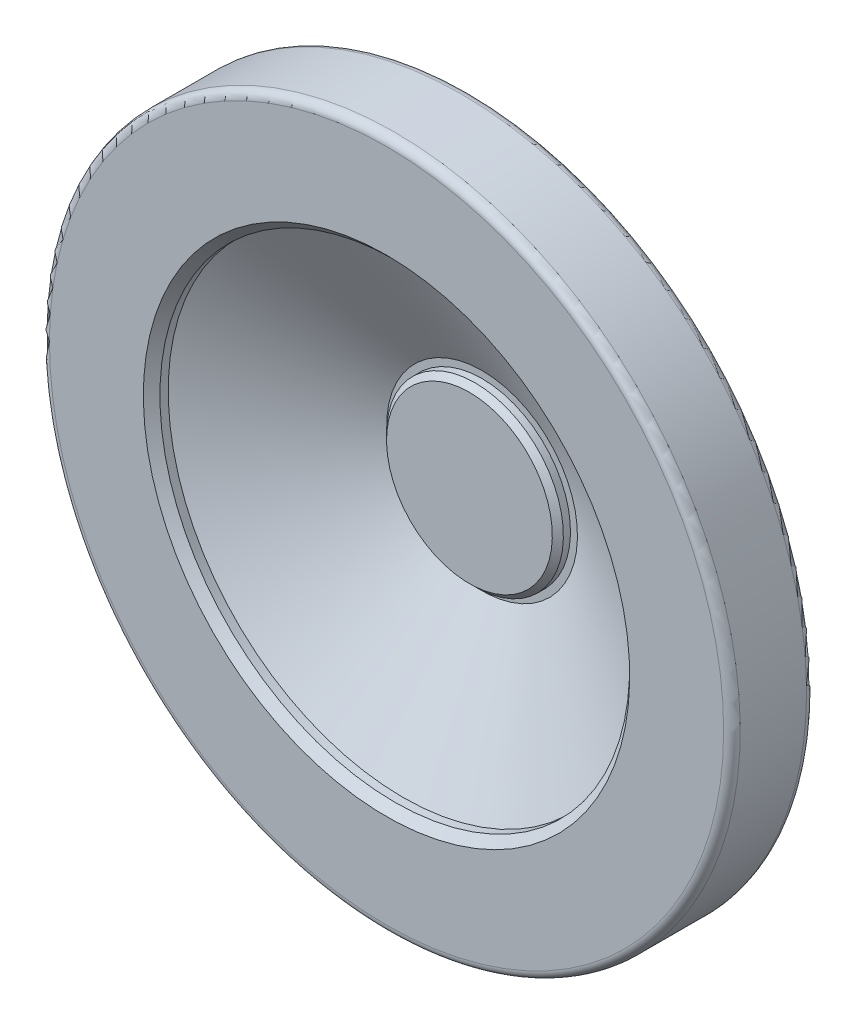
ISO-10303-21;
HEADER;
FILE_DESCRIPTION(('STEP AP214'),'2;1');
FILE_NAME('part.step','',(''),(''),'','','');
FILE_SCHEMA(('AUTOMOTIVE_DESIGN { 1 0 10303 214 1 1 1 1 }'));
ENDSEC;
DATA;
#1=APPLICATION_CONTEXT('core data for automotive mechanical design processes');
#2=APPLICATION_PROTOCOL_DEFINITION('international standard','automotive_design',2000,#1);
#3=PRODUCT_CONTEXT('',#1,'mechanical');
#4=PRODUCT('Part','Part','',(#3));
#5=PRODUCT_RELATED_PRODUCT_CATEGORY('part','',(#4));
#6=PRODUCT_DEFINITION_FORMATION('','',#4);
#7=PRODUCT_DEFINITION_CONTEXT('part definition',#1,'design');
#8=PRODUCT_DEFINITION('design','',#6,#7);
#9=PRODUCT_DEFINITION_SHAPE('','',#8);
#10=(LENGTH_UNIT() NAMED_UNIT(*) SI_UNIT(.MILLI.,.METRE.));
#11=(NAMED_UNIT(*) PLANE_ANGLE_UNIT() SI_UNIT($,.RADIAN.));
#12=(NAMED_UNIT(*) SI_UNIT($,.STERADIAN.) SOLID_ANGLE_UNIT());
#13=UNCERTAINTY_MEASURE_WITH_UNIT(LENGTH_MEASURE(1.E-05),#10,'distance_accuracy_value','');
#14=(GEOMETRIC_REPRESENTATION_CONTEXT(3) GLOBAL_UNCERTAINTY_ASSIGNED_CONTEXT((#13)) GLOBAL_UNIT_ASSIGNED_CONTEXT((#10,
#11,#12)) REPRESENTATION_CONTEXT('',''));
#15=CARTESIAN_POINT('',(0.,0.,0.));
#16=DIRECTION('',(0.,0.,1.));
#17=DIRECTION('',(1.,0.,0.));
#18=AXIS2_PLACEMENT_3D('',#15,#16,#17);
#19=CARTESIAN_POINT('',(0.,0.,10.9999999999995));
#20=DIRECTION('',(0.,0.,-1.));
#21=DIRECTION('',(0.,-1.,0.));
#22=AXIS2_PLACEMENT_3D('',#19,#20,#21);
#23=CONICAL_SURFACE('',#22,2.99999999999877,1.0471975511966);
#24=CARTESIAN_POINT('',(0.,0.,12.732050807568));
#25=VERTEX_POINT('',#24);
#26=VERTEX_LOOP('',#25);
#27=FACE_BOUND('',#26,.T.);
#28=CARTESIAN_POINT('',(0.,0.,10.9999999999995));
#29=DIRECTION('',(0.,0.,1.));
#30=DIRECTION('',(0.,1.,0.));
#31=AXIS2_PLACEMENT_3D('',#28,#29,#30);
#32=CIRCLE('',#31,2.99999999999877);
#33=CARTESIAN_POINT('',(0.,2.99999999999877,10.9999999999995));
#34=VERTEX_POINT('',#33);
#35=EDGE_CURVE('E9',#34,#34,#32,.T.);
#36=ORIENTED_EDGE('',*,*,#35,.F.);
#37=EDGE_LOOP('',(#36));
#38=FACE_BOUND('',#37,.T.);
#39=ADVANCED_FACE('F14',(#27,#38),#23,.F.);
#40=CARTESIAN_POINT('',(0.,0.,53.));
#41=DIRECTION('',(0.,0.,1.));
#42=DIRECTION('',(0.,1.,0.));
#43=AXIS2_PLACEMENT_3D('',#40,#41,#42);
#44=CYLINDRICAL_SURFACE('',#43,2.99999999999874);
#45=ORIENTED_EDGE('',*,*,#35,.T.);
#46=EDGE_LOOP('',(#45));
#47=FACE_BOUND('',#46,.T.);
#48=CARTESIAN_POINT('',(0.,0.,0.));
#49=DIRECTION('',(0.,0.,1.));
#50=DIRECTION('',(0.,1.,0.));
#51=AXIS2_PLACEMENT_3D('',#48,#49,#50);
#52=CIRCLE('',#51,2.99999999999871);
#53=CARTESIAN_POINT('',(0.,2.99999999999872,0.));
#54=VERTEX_POINT('',#53);
#55=EDGE_CURVE('E20',#54,#54,#52,.T.);
#56=ORIENTED_EDGE('',*,*,#55,.F.);
#57=EDGE_LOOP('',(#56));
#58=FACE_BOUND('',#57,.T.);
#59=ADVANCED_FACE('F25',(#47,#58),#44,.F.);
#60=CARTESIAN_POINT('',(0.,-15.,0.));
#61=DIRECTION('',(0.,0.,-1.));
#62=DIRECTION('',(0.,-1.,0.));
#63=AXIS2_PLACEMENT_3D('',#60,#61,#62);
#64=PLANE('',#63);
#65=ORIENTED_EDGE('',*,*,#55,.T.);
#66=EDGE_LOOP('',(#65));
#67=FACE_BOUND('',#66,.T.);
#68=CARTESIAN_POINT('',(0.,0.,0.));
#69=DIRECTION('',(0.,0.,1.));
#70=DIRECTION('',(0.,1.,0.));
#71=AXIS2_PLACEMENT_3D('',#68,#69,#70);
#72=CIRCLE('',#71,15.);
#73=CARTESIAN_POINT('',(0.,15.,0.));
#74=VERTEX_POINT('',#73);
#75=EDGE_CURVE('E34',#74,#74,#72,.T.);
#76=ORIENTED_EDGE('',*,*,#75,.F.);
#77=EDGE_LOOP('',(#76));
#78=FACE_BOUND('',#77,.T.);
#79=ADVANCED_FACE('F30',(#67,#78),#64,.T.);
#80=CARTESIAN_POINT('',(0.,0.,1.));
#81=DIRECTION('',(0.,0.,1.));
#82=DIRECTION('',(0.,1.,0.));
#83=AXIS2_PLACEMENT_3D('',#80,#81,#82);
#84=CONICAL_SURFACE('',#83,16.,0.785398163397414);
#85=ORIENTED_EDGE('',*,*,#75,.T.);
#86=EDGE_LOOP('',(#85));
#87=FACE_BOUND('',#86,.T.);
#88=CARTESIAN_POINT('',(0.,0.,1.));
#89=DIRECTION('',(0.,0.,1.));
#90=DIRECTION('',(0.,1.,0.));
#91=AXIS2_PLACEMENT_3D('',#88,#89,#90);
#92=CIRCLE('',#91,16.);
#93=CARTESIAN_POINT('',(0.,16.,0.999999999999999));
#94=VERTEX_POINT('',#93);
#95=EDGE_CURVE('E36',#94,#94,#92,.T.);
#96=ORIENTED_EDGE('',*,*,#95,.F.);
#97=EDGE_LOOP('',(#96));
#98=FACE_BOUND('',#97,.T.);
#99=ADVANCED_FACE('F169',(#87,#98),#84,.T.);
#100=CARTESIAN_POINT('',(0.,0.,53.));
#101=DIRECTION('',(0.,0.,1.));
#102=DIRECTION('',(0.,1.,0.));
#103=AXIS2_PLACEMENT_3D('',#100,#101,#102);
#104=CYLINDRICAL_SURFACE('',#103,16.);
#105=CARTESIAN_POINT('',(0.,0.,15.6));
#106=DIRECTION('',(0.,0.,1.));
#107=DIRECTION('',(0.,1.,0.));
#108=AXIS2_PLACEMENT_3D('',#105,#106,#107);
#109=CIRCLE('',#108,16.);
#110=CARTESIAN_POINT('',(0.,16.,15.6));
#111=VERTEX_POINT('',#110);
#112=EDGE_CURVE('E41',#111,#111,#109,.T.);
#113=ORIENTED_EDGE('',*,*,#112,.F.);
#114=EDGE_LOOP('',(#113));
#115=FACE_BOUND('',#114,.T.);
#116=ORIENTED_EDGE('',*,*,#95,.T.);
#117=EDGE_LOOP('',(#116));
#118=FACE_BOUND('',#117,.T.);
#119=ADVANCED_FACE('F165',(#115,#118),#104,.T.);
#120=CARTESIAN_POINT('',(0.,0.,15.6));
#121=DIRECTION('',(0.,0.,1.));
#122=DIRECTION('',(0.,1.,0.));
#123=AXIS2_PLACEMENT_3D('',#120,#121,#122);
#124=TOROIDAL_SURFACE('',#123,16.4,0.399999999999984);
#125=ORIENTED_EDGE('',*,*,#112,.T.);
#126=EDGE_LOOP('',(#125));
#127=FACE_BOUND('',#126,.T.);
#128=CARTESIAN_POINT('',(0.,0.,15.9999999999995));
#129=DIRECTION('',(0.,0.,1.));
#130=DIRECTION('',(0.,1.,0.));
#131=AXIS2_PLACEMENT_3D('',#128,#129,#130);
#132=CIRCLE('',#131,16.4);
#133=CARTESIAN_POINT('',(0.,16.4,15.9999999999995));
#134=VERTEX_POINT('',#133);
#135=EDGE_CURVE('E44',#134,#134,#132,.T.);
#136=ORIENTED_EDGE('',*,*,#135,.F.);
#137=EDGE_LOOP('',(#136));
#138=FACE_BOUND('',#137,.T.);
#139=ADVANCED_FACE('F161',(#127,#138),#124,.F.);
#140=CARTESIAN_POINT('',(0.,-16.4,15.9999999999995));
#141=DIRECTION('',(0.,0.,1.));
#142=DIRECTION('',(0.,1.,0.));
#143=AXIS2_PLACEMENT_3D('',#140,#141,#142);
#144=PLANE('',#143);
#145=CARTESIAN_POINT('',(0.,0.,15.9999999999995));
#146=DIRECTION('',(0.,0.,1.));
#147=DIRECTION('',(0.,1.,0.));
#148=AXIS2_PLACEMENT_3D('',#145,#146,#147);
#149=CIRCLE('',#148,18.);
#150=CARTESIAN_POINT('',(0.,18.,15.9999999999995));
#151=VERTEX_POINT('',#150);
#152=EDGE_CURVE('E47',#151,#151,#149,.T.);
#153=ORIENTED_EDGE('',*,*,#152,.F.);
#154=EDGE_LOOP('',(#153));
#155=FACE_BOUND('',#154,.T.);
#156=ORIENTED_EDGE('',*,*,#135,.T.);
#157=EDGE_LOOP('',(#156));
#158=FACE_BOUND('',#157,.T.);
#159=ADVANCED_FACE('F157',(#155,#158),#144,.F.);
#160=CARTESIAN_POINT('',(0.,0.,53.));
#161=DIRECTION('',(0.,0.,1.));
#162=DIRECTION('',(0.,1.,0.));
#163=AXIS2_PLACEMENT_3D('',#160,#161,#162);
#164=CYLINDRICAL_SURFACE('',#163,18.);
#165=CARTESIAN_POINT('',(0.,0.,17.5501654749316));
#166=DIRECTION('',(0.,0.,1.));
#167=DIRECTION('',(0.,1.,0.));
#168=AXIS2_PLACEMENT_3D('',#165,#166,#167);
#169=CIRCLE('',#168,18.);
#170=CARTESIAN_POINT('',(0.,18.,17.5501654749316));
#171=VERTEX_POINT('',#170);
#172=EDGE_CURVE('E50',#171,#171,#169,.T.);
#173=ORIENTED_EDGE('',*,*,#172,.F.);
#174=EDGE_LOOP('',(#173));
#175=FACE_BOUND('',#174,.T.);
#176=ORIENTED_EDGE('',*,*,#152,.T.);
#177=EDGE_LOOP('',(#176));
#178=FACE_BOUND('',#177,.T.);
#179=ADVANCED_FACE('F153',(#175,#178),#164,.T.);
#180=CARTESIAN_POINT('',(0.,0.,17.5501654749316));
#181=DIRECTION('',(0.,0.,1.));
#182=DIRECTION('',(0.,1.,0.));
#183=AXIS2_PLACEMENT_3D('',#180,#181,#182);
#184=TOROIDAL_SURFACE('',#183,23.,5.);
#185=ORIENTED_EDGE('',*,*,#172,.T.);
#186=EDGE_LOOP('',(#185));
#187=FACE_BOUND('',#186,.T.);
#188=CARTESIAN_POINT('',(0.,0.,21.75863588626));
#189=DIRECTION('',(0.,0.,1.));
#190=DIRECTION('',(0.,1.,0.));
#191=AXIS2_PLACEMENT_3D('',#188,#189,#190);
#192=CIRCLE('',#191,20.3002265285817);
#193=CARTESIAN_POINT('',(0.,20.3002265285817,21.75863588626));
#194=VERTEX_POINT('',#193);
#195=EDGE_CURVE('E53',#194,#194,#192,.T.);
#196=ORIENTED_EDGE('',*,*,#195,.F.);
#197=EDGE_LOOP('',(#196));
#198=FACE_BOUND('',#197,.T.);
#199=ADVANCED_FACE('F149',(#187,#198),#184,.F.);
#200=CARTESIAN_POINT('',(0.,0.,27.9999999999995));
#201=DIRECTION('',(0.,0.,1.));
#202=DIRECTION('',(0.,1.,0.));
#203=AXIS2_PLACEMENT_3D('',#200,#201,#202);
#204=CONICAL_SURFACE('',#203,30.029411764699,1.00041304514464);
#205=ORIENTED_EDGE('',*,*,#195,.T.);
#206=EDGE_LOOP('',(#205));
#207=FACE_BOUND('',#206,.T.);
#208=CARTESIAN_POINT('',(0.,0.,27.9999999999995));
#209=DIRECTION('',(0.,0.,1.));
#210=DIRECTION('',(0.,1.,0.));
#211=AXIS2_PLACEMENT_3D('',#208,#209,#210);
#212=CIRCLE('',#211,30.029411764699);
#213=CARTESIAN_POINT('',(0.,30.0294117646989,27.9999999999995));
#214=VERTEX_POINT('',#213);
#215=EDGE_CURVE('E56',#214,#214,#212,.T.);
#216=ORIENTED_EDGE('',*,*,#215,.F.);
#217=EDGE_LOOP('',(#216));
#218=FACE_BOUND('',#217,.T.);
#219=ADVANCED_FACE('F145',(#207,#218),#204,.T.);
#220=CARTESIAN_POINT('',(0.,-61.,27.9999999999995));
#221=DIRECTION('',(0.,0.,-1.));
#222=DIRECTION('',(0.,-1.,0.));
#223=AXIS2_PLACEMENT_3D('',#220,#221,#222);
#224=PLANE('',#223);
#225=ORIENTED_EDGE('',*,*,#215,.T.);
#226=EDGE_LOOP('',(#225));
#227=FACE_BOUND('',#226,.T.);
#228=CARTESIAN_POINT('',(0.,0.,27.9999999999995));
#229=DIRECTION('',(0.,0.,1.));
#230=DIRECTION('',(0.,1.,0.));
#231=AXIS2_PLACEMENT_3D('',#228,#229,#230);
#232=CIRCLE('',#231,61.);
#233=CARTESIAN_POINT('',(0.,61.,27.9999999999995));
#234=VERTEX_POINT('',#233);
#235=EDGE_CURVE('E59',#234,#234,#232,.T.);
#236=ORIENTED_EDGE('',*,*,#235,.F.);
#237=EDGE_LOOP('',(#236));
#238=FACE_BOUND('',#237,.T.);
#239=ADVANCED_FACE('F141',(#227,#238),#224,.T.);
#240=CARTESIAN_POINT('',(0.,0.,29.4999999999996));
#241=DIRECTION('',(0.,0.,1.));
#242=DIRECTION('',(0.,1.,0.));
#243=AXIS2_PLACEMENT_3D('',#240,#241,#242);
#244=TOROIDAL_SURFACE('',#243,61.,1.5);
#245=CARTESIAN_POINT('',(0.,0.,29.4999999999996));
#246=DIRECTION('',(0.,0.,1.));
#247=DIRECTION('',(0.,1.,0.));
#248=AXIS2_PLACEMENT_3D('',#245,#246,#247);
#249=CIRCLE('',#248,62.5);
#250=CARTESIAN_POINT('',(0.,62.5,29.4999999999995));
#251=VERTEX_POINT('',#250);
#252=EDGE_CURVE('E62',#251,#251,#249,.T.);
#253=ORIENTED_EDGE('',*,*,#252,.F.);
#254=EDGE_LOOP('',(#253));
#255=FACE_BOUND('',#254,.T.);
#256=ORIENTED_EDGE('',*,*,#235,.T.);
#257=EDGE_LOOP('',(#256));
#258=FACE_BOUND('',#257,.T.);
#259=ADVANCED_FACE('F137',(#255,#258),#244,.T.);
#260=CARTESIAN_POINT('',(0.,0.,53.));
#261=DIRECTION('',(0.,0.,1.));
#262=DIRECTION('',(0.,1.,0.));
#263=AXIS2_PLACEMENT_3D('',#260,#261,#262);
#264=CYLINDRICAL_SURFACE('',#263,62.5);
#265=ORIENTED_EDGE('',*,*,#252,.T.);
#266=EDGE_LOOP('',(#265));
#267=FACE_BOUND('',#266,.T.);
#268=CARTESIAN_POINT('',(0.,0.,41.4999999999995));
#269=DIRECTION('',(0.,0.,1.));
#270=DIRECTION('',(0.,1.,0.));
#271=AXIS2_PLACEMENT_3D('',#268,#269,#270);
#272=CIRCLE('',#271,62.5);
#273=CARTESIAN_POINT('',(0.,62.5,41.4999999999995));
#274=VERTEX_POINT('',#273);
#275=EDGE_CURVE('E65',#274,#274,#272,.T.);
#276=ORIENTED_EDGE('',*,*,#275,.F.);
#277=EDGE_LOOP('',(#276));
#278=FACE_BOUND('',#277,.T.);
#279=ADVANCED_FACE('F133',(#267,#278),#264,.T.);
#280=CARTESIAN_POINT('',(0.,0.,41.4999999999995));
#281=DIRECTION('',(0.,0.,1.));
#282=DIRECTION('',(0.,1.,0.));
#283=AXIS2_PLACEMENT_3D('',#280,#281,#282);
#284=TOROIDAL_SURFACE('',#283,61.,1.5);
#285=CARTESIAN_POINT('',(0.,0.,42.9999999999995));
#286=DIRECTION('',(0.,0.,1.));
#287=DIRECTION('',(0.,1.,0.));
#288=AXIS2_PLACEMENT_3D('',#285,#286,#287);
#289=CIRCLE('',#288,61.);
#290=CARTESIAN_POINT('',(0.,61.,42.9999999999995));
#291=VERTEX_POINT('',#290);
#292=EDGE_CURVE('E68',#291,#291,#289,.T.);
#293=ORIENTED_EDGE('',*,*,#292,.F.);
#294=EDGE_LOOP('',(#293));
#295=FACE_BOUND('',#294,.T.);
#296=ORIENTED_EDGE('',*,*,#275,.T.);
#297=EDGE_LOOP('',(#296));
#298=FACE_BOUND('',#297,.T.);
#299=ADVANCED_FACE('F129',(#295,#298),#284,.T.);
#300=CARTESIAN_POINT('',(0.,-61.,43.));
#301=DIRECTION('',(0.,0.,-1.));
#302=DIRECTION('',(0.,-1.,0.));
#303=AXIS2_PLACEMENT_3D('',#300,#301,#302);
#304=PLANE('',#303);
#305=CARTESIAN_POINT('',(0.,0.,42.9999999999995));
#306=DIRECTION('',(0.,0.,1.));
#307=DIRECTION('',(0.,1.,0.));
#308=AXIS2_PLACEMENT_3D('',#305,#306,#307);
#309=CIRCLE('',#308,44.);
#310=CARTESIAN_POINT('',(0.,44.,42.9999999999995));
#311=VERTEX_POINT('',#310);
#312=EDGE_CURVE('E71',#311,#311,#309,.T.);
#313=ORIENTED_EDGE('',*,*,#312,.F.);
#314=EDGE_LOOP('',(#313));
#315=FACE_BOUND('',#314,.T.);
#316=ORIENTED_EDGE('',*,*,#292,.T.);
#317=EDGE_LOOP('',(#316));
#318=FACE_BOUND('',#317,.T.);
#319=ADVANCED_FACE('F125',(#315,#318),#304,.F.);
#320=CARTESIAN_POINT('',(0.,0.,41.4999999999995));
#321=DIRECTION('',(0.,0.,1.));
#322=DIRECTION('',(0.,1.,0.));
#323=AXIS2_PLACEMENT_3D('',#320,#321,#322);
#324=CONICAL_SURFACE('',#323,42.5,0.785398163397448);
#325=ORIENTED_EDGE('',*,*,#312,.T.);
#326=EDGE_LOOP('',(#325));
#327=FACE_BOUND('',#326,.T.);
#328=CARTESIAN_POINT('',(0.,0.,41.4999999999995));
#329=DIRECTION('',(0.,0.,1.));
#330=DIRECTION('',(0.,1.,0.));
#331=AXIS2_PLACEMENT_3D('',#328,#329,#330);
#332=CIRCLE('',#331,42.5);
#333=CARTESIAN_POINT('',(0.,42.5,41.4999999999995));
#334=VERTEX_POINT('',#333);
#335=EDGE_CURVE('E74',#334,#334,#332,.T.);
#336=ORIENTED_EDGE('',*,*,#335,.F.);
#337=EDGE_LOOP('',(#336));
#338=FACE_BOUND('',#337,.T.);
#339=ADVANCED_FACE('F121',(#327,#338),#324,.F.);
#340=CARTESIAN_POINT('',(0.,0.,53.));
#341=DIRECTION('',(0.,0.,1.));
#342=DIRECTION('',(0.,1.,0.));
#343=AXIS2_PLACEMENT_3D('',#340,#341,#342);
#344=CYLINDRICAL_SURFACE('',#343,42.5);
#345=CARTESIAN_POINT('',(0.,0.,39.9999999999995));
#346=DIRECTION('',(0.,0.,1.));
#347=DIRECTION('',(0.,1.,0.));
#348=AXIS2_PLACEMENT_3D('',#345,#346,#347);
#349=CIRCLE('',#348,42.5);
#350=CARTESIAN_POINT('',(0.,42.5,39.9999999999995));
#351=VERTEX_POINT('',#350);
#352=EDGE_CURVE('E77',#351,#351,#349,.T.);
#353=ORIENTED_EDGE('',*,*,#352,.F.);
#354=EDGE_LOOP('',(#353));
#355=FACE_BOUND('',#354,.T.);
#356=ORIENTED_EDGE('',*,*,#335,.T.);
#357=EDGE_LOOP('',(#356));
#358=FACE_BOUND('',#357,.T.);
#359=ADVANCED_FACE('F117',(#355,#358),#344,.F.);
#360=CARTESIAN_POINT('',(0.,0.,39.9999999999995));
#361=DIRECTION('',(0.,0.,1.));
#362=DIRECTION('',(0.,1.,0.));
#363=AXIS2_PLACEMENT_3D('',#360,#361,#362);
#364=CONICAL_SURFACE('',#363,42.5,1.05572350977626);
#365=CARTESIAN_POINT('',(0.,0.,25.7151237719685));
#366=DIRECTION('',(0.,0.,1.));
#367=DIRECTION('',(0.,1.,0.));
#368=AXIS2_PLACEMENT_3D('',#365,#366,#367);
#369=CIRCLE('',#368,17.2633853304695);
#370=CARTESIAN_POINT('',(0.,17.2633853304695,25.7151237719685));
#371=VERTEX_POINT('',#370);
#372=EDGE_CURVE('E80',#371,#371,#369,.T.);
#373=ORIENTED_EDGE('',*,*,#372,.F.);
#374=EDGE_LOOP('',(#373));
#375=FACE_BOUND('',#374,.T.);
#376=ORIENTED_EDGE('',*,*,#352,.T.);
#377=EDGE_LOOP('',(#376));
#378=FACE_BOUND('',#377,.T.);
#379=ADVANCED_FACE('F113',(#375,#378),#364,.F.);
#380=CARTESIAN_POINT('',(0.,-17.2633853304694,25.7151237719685));
#381=DIRECTION('',(0.,0.,-1.));
#382=DIRECTION('',(0.,-1.,0.));
#383=AXIS2_PLACEMENT_3D('',#380,#381,#382);
#384=PLANE('',#383);
#385=CARTESIAN_POINT('',(0.,0.,25.7151237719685));
#386=DIRECTION('',(0.,0.,1.));
#387=DIRECTION('',(0.,1.,0.));
#388=AXIS2_PLACEMENT_3D('',#385,#386,#387);
#389=CIRCLE('',#388,16.);
#390=CARTESIAN_POINT('',(0.,16.,25.7151237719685));
#391=VERTEX_POINT('',#390);
#392=EDGE_CURVE('E83',#391,#391,#389,.T.);
#393=ORIENTED_EDGE('',*,*,#392,.F.);
#394=EDGE_LOOP('',(#393));
#395=FACE_BOUND('',#394,.T.);
#396=ORIENTED_EDGE('',*,*,#372,.T.);
#397=EDGE_LOOP('',(#396));
#398=FACE_BOUND('',#397,.T.);
#399=ADVANCED_FACE('F107',(#395,#398),#384,.F.);
#400=CARTESIAN_POINT('',(0.,0.,53.));
#401=DIRECTION('',(0.,0.,1.));
#402=DIRECTION('',(0.,1.,0.));
#403=AXIS2_PLACEMENT_3D('',#400,#401,#402);
#404=CYLINDRICAL_SURFACE('',#403,16.);
#405=CARTESIAN_POINT('',(0.,0.,26.9999999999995));
#406=DIRECTION('',(0.,0.,1.));
#407=DIRECTION('',(0.,1.,0.));
#408=AXIS2_PLACEMENT_3D('',#405,#406,#407);
#409=CIRCLE('',#408,16.);
#410=CARTESIAN_POINT('',(0.,16.,26.9999999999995));
#411=VERTEX_POINT('',#410);
#412=EDGE_CURVE('E86',#411,#411,#409,.T.);
#413=ORIENTED_EDGE('',*,*,#412,.F.);
#414=EDGE_LOOP('',(#413));
#415=FACE_BOUND('',#414,.T.);
#416=ORIENTED_EDGE('',*,*,#392,.T.);
#417=EDGE_LOOP('',(#416));
#418=FACE_BOUND('',#417,.T.);
#419=ADVANCED_FACE('F97',(#415,#418),#404,.T.);
#420=CARTESIAN_POINT('',(0.,0.,27.9999999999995));
#421=DIRECTION('',(0.,0.,-1.));
#422=DIRECTION('',(0.,-1.,0.));
#423=AXIS2_PLACEMENT_3D('',#420,#421,#422);
#424=CONICAL_SURFACE('',#423,15.,0.785398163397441);
#425=ORIENTED_EDGE('',*,*,#412,.T.);
#426=EDGE_LOOP('',(#425));
#427=FACE_BOUND('',#426,.T.);
#428=CARTESIAN_POINT('',(0.,0.,27.9999999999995));
#429=DIRECTION('',(0.,0.,1.));
#430=DIRECTION('',(0.,1.,0.));
#431=AXIS2_PLACEMENT_3D('',#428,#429,#430);
#432=CIRCLE('',#431,15.);
#433=CARTESIAN_POINT('',(0.,15.,27.9999999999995));
#434=VERTEX_POINT('',#433);
#435=EDGE_CURVE('E89',#434,#434,#432,.T.);
#436=ORIENTED_EDGE('',*,*,#435,.F.);
#437=EDGE_LOOP('',(#436));
#438=FACE_BOUND('',#437,.T.);
#439=ADVANCED_FACE('F95',(#427,#438),#424,.T.);
#440=CARTESIAN_POINT('',(0.,-15.,27.9999999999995));
#441=DIRECTION('',(0.,0.,-1.));
#442=DIRECTION('',(0.,-1.,0.));
#443=AXIS2_PLACEMENT_3D('',#440,#441,#442);
#444=PLANE('',#443);
#445=ORIENTED_EDGE('',*,*,#435,.T.);
#446=EDGE_LOOP('',(#445));
#447=FACE_BOUND('',#446,.T.);
#448=ADVANCED_FACE('F93',(#447),#444,.F.);
#449=CLOSED_SHELL('',(#39,#59,#79,#99,#119,#139,#159,#179,#199,#219,#239,#259,#279,#299,#319,
#339,#359,#379,#399,#419,#439,#448));
#450=MANIFOLD_SOLID_BREP('B1',#449);
#451=ADVANCED_BREP_SHAPE_REPRESENTATION('',(#18,#450),#14);
#452=SHAPE_DEFINITION_REPRESENTATION(#9,#451);
ENDSEC;
END-ISO-10303-21;
